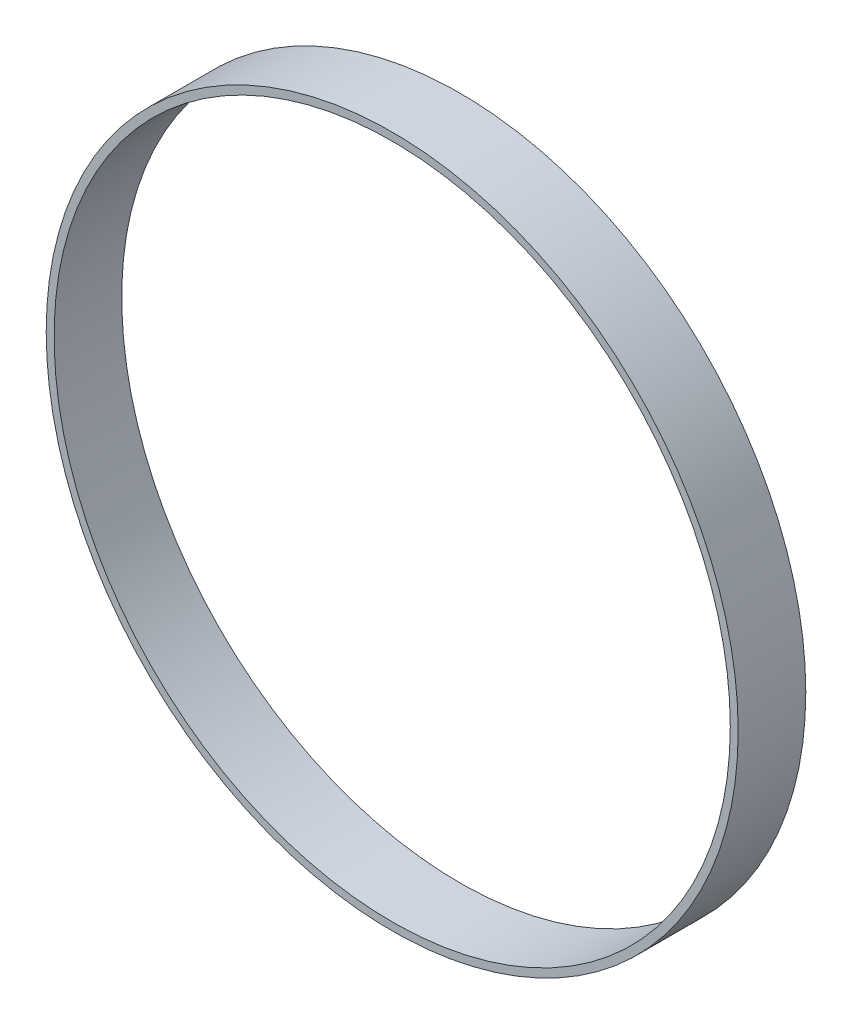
from build123d import *

# Parameters (mm, degrees)
ESQUISSE1_R      = 30.7
ESQUISSE1_R_2    = 30
EXTRUSION1_DEPTH = 6


with BuildPart() as part:
    # Esquisse1 → Extrusion1 (new body)
    with BuildSketch(Plane.XY):
        Circle(ESQUISSE1_R)
        Circle(ESQUISSE1_R_2, mode=Mode.SUBTRACT)
    extrude(amount=EXTRUSION1_DEPTH)


solid = part.part
